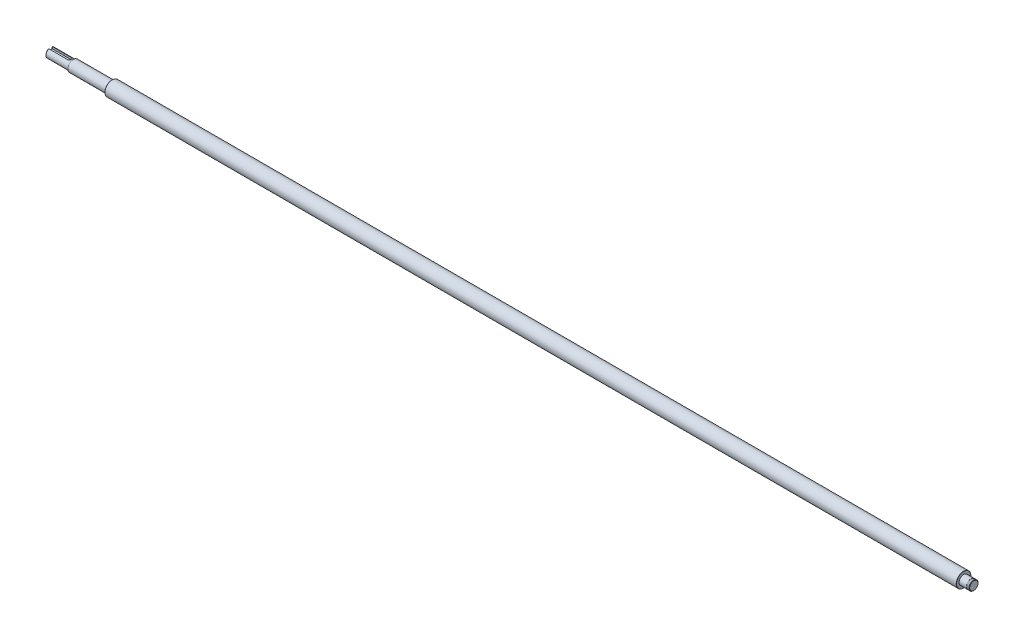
ISO-10303-21;
HEADER;
FILE_DESCRIPTION(('STEP AP214'),'2;1');
FILE_NAME('part.step','',(''),(''),'','','');
FILE_SCHEMA(('AUTOMOTIVE_DESIGN { 1 0 10303 214 1 1 1 1 }'));
ENDSEC;
DATA;
#1=APPLICATION_CONTEXT('core data for automotive mechanical design processes');
#2=APPLICATION_PROTOCOL_DEFINITION('international standard','automotive_design',2000,#1);
#3=PRODUCT_CONTEXT('',#1,'mechanical');
#4=PRODUCT('Part','Part','',(#3));
#5=PRODUCT_RELATED_PRODUCT_CATEGORY('part','',(#4));
#6=PRODUCT_DEFINITION_FORMATION('','',#4);
#7=PRODUCT_DEFINITION_CONTEXT('part definition',#1,'design');
#8=PRODUCT_DEFINITION('design','',#6,#7);
#9=PRODUCT_DEFINITION_SHAPE('','',#8);
#10=(LENGTH_UNIT() NAMED_UNIT(*) SI_UNIT(.MILLI.,.METRE.));
#11=(NAMED_UNIT(*) PLANE_ANGLE_UNIT() SI_UNIT($,.RADIAN.));
#12=(NAMED_UNIT(*) SI_UNIT($,.STERADIAN.) SOLID_ANGLE_UNIT());
#13=UNCERTAINTY_MEASURE_WITH_UNIT(LENGTH_MEASURE(1.E-05),#10,'distance_accuracy_value','');
#14=(GEOMETRIC_REPRESENTATION_CONTEXT(3) GLOBAL_UNCERTAINTY_ASSIGNED_CONTEXT((#13)) GLOBAL_UNIT_ASSIGNED_CONTEXT((#10,
#11,#12)) REPRESENTATION_CONTEXT('',''));
#15=CARTESIAN_POINT('',(0.,0.,0.));
#16=DIRECTION('',(0.,0.,1.));
#17=DIRECTION('',(1.,0.,0.));
#18=AXIS2_PLACEMENT_3D('',#15,#16,#17);
#19=CARTESIAN_POINT('',(-23.2450331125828,0.,0.));
#20=DIRECTION('',(-1.,0.,0.));
#21=DIRECTION('',(0.,-1.,0.));
#22=AXIS2_PLACEMENT_3D('',#19,#20,#21);
#23=PLANE('',#22);
#24=DIRECTION('',(0.,1.,0.));
#25=VECTOR('',#24,1.);
#26=CARTESIAN_POINT('',(-23.2450331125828,2.5,-2.));
#27=LINE('',#26,#25);
#28=CARTESIAN_POINT('',(-23.2450331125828,2.5,-2.));
#29=VERTEX_POINT('',#28);
#30=CARTESIAN_POINT('',(-23.2450331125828,4.03112887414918,-2.));
#31=VERTEX_POINT('',#30);
#32=EDGE_CURVE('E132',#29,#31,#27,.T.);
#33=ORIENTED_EDGE('',*,*,#32,.T.);
#34=CARTESIAN_POINT('',(-23.2450331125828,0.,0.));
#35=DIRECTION('',(-1.,0.,0.));
#36=DIRECTION('',(0.,-1.,0.));
#37=AXIS2_PLACEMENT_3D('',#34,#35,#36);
#38=CIRCLE('',#37,4.49999999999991);
#39=CARTESIAN_POINT('',(-23.2450331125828,4.03112887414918,2.));
#40=VERTEX_POINT('',#39);
#41=EDGE_CURVE('E119',#31,#40,#38,.T.);
#42=ORIENTED_EDGE('',*,*,#41,.T.);
#43=DIRECTION('',(0.,1.,0.));
#44=VECTOR('',#43,1.);
#45=CARTESIAN_POINT('',(-23.2450331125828,2.5,2.));
#46=LINE('',#45,#44);
#47=CARTESIAN_POINT('',(-23.2450331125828,2.5,2.));
#48=VERTEX_POINT('',#47);
#49=EDGE_CURVE('E68',#48,#40,#46,.T.);
#50=ORIENTED_EDGE('',*,*,#49,.F.);
#51=DIRECTION('',(0.,0.,-1.));
#52=VECTOR('',#51,1.);
#53=CARTESIAN_POINT('',(-23.2450331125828,2.5,0.));
#54=LINE('',#53,#52);
#55=EDGE_CURVE('E11',#48,#29,#54,.T.);
#56=ORIENTED_EDGE('',*,*,#55,.T.);
#57=EDGE_LOOP('',(#33,#42,#50,#56));
#58=FACE_BOUND('',#57,.T.);
#59=ADVANCED_FACE('F51',(#58),#23,.T.);
#60=CARTESIAN_POINT('',(976.754966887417,1.22298005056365E-13,0.));
#61=DIRECTION('',(1.,0.,0.));
#62=DIRECTION('',(0.,1.,0.));
#63=AXIS2_PLACEMENT_3D('',#60,#61,#62);
#64=CYLINDRICAL_SURFACE('',#63,5.);
#65=CARTESIAN_POINT('',(-2.24503311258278,4.58257569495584,2.));
#66=CARTESIAN_POINT('',(-2.19122726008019,4.58256464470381,2.00000798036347));
#67=CARTESIAN_POINT('',(-2.13742744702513,4.58352306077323,1.99782891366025));
#68=CARTESIAN_POINT('',(-2.03026181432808,4.58729625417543,1.98915905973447));
#69=CARTESIAN_POINT('',(-1.97689583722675,4.59011032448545,1.98266991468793));
#70=CARTESIAN_POINT('',(-1.87118629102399,4.5974978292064,1.9654760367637));
#71=CARTESIAN_POINT('',(-1.81883952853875,4.60206430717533,1.95478796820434));
#72=CARTESIAN_POINT('',(-1.71533234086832,4.61280053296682,1.9293163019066));
#73=CARTESIAN_POINT('',(-1.66417198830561,4.61897037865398,1.9145324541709));
#74=CARTESIAN_POINT('',(-1.51309726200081,4.63959291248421,1.86426971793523));
#75=CARTESIAN_POINT('',(-1.41537888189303,4.6561744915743,1.82284489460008));
#76=CARTESIAN_POINT('',(-1.22823753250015,4.6931237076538,1.72548191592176));
#77=CARTESIAN_POINT('',(-1.13882255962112,4.71349493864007,1.66952996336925));
#78=CARTESIAN_POINT('',(-0.965770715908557,4.75700999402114,1.54131835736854));
#79=CARTESIAN_POINT('',(-0.88266589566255,4.78024245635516,1.4683691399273));
#80=CARTESIAN_POINT('',(-0.729492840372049,4.82612790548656,1.30969646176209));
#81=CARTESIAN_POINT('',(-0.659427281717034,4.84878077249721,1.22397038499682));
#82=CARTESIAN_POINT('',(-0.53162671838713,4.89203417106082,1.03800590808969));
#83=CARTESIAN_POINT('',(-0.474488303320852,4.91251824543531,0.937327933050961));
#84=CARTESIAN_POINT('',(-0.378189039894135,4.94803944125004,0.726824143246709));
#85=CARTESIAN_POINT('',(-0.339020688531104,4.96307883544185,0.617002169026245));
#86=CARTESIAN_POINT('',(-0.281691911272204,4.98538314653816,0.396967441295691));
#87=CARTESIAN_POINT('',(-0.262606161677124,4.99298922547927,0.28703105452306));
#88=CARTESIAN_POINT('',(-0.243004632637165,5.00080310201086,0.0652684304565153));
#89=CARTESIAN_POINT('',(-0.242482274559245,5.0010135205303,-0.0465571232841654));
#90=CARTESIAN_POINT('',(-0.259515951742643,4.99421960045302,-0.262233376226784));
#91=CARTESIAN_POINT('',(-0.276058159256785,4.98761985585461,-0.366179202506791));
#92=CARTESIAN_POINT('',(-0.325026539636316,4.96849270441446,-0.569674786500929));
#93=CARTESIAN_POINT('',(-0.357453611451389,4.95596496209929,-0.669224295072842));
#94=CARTESIAN_POINT('',(-0.437669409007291,4.92596830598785,-0.862897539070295));
#95=CARTESIAN_POINT('',(-0.485682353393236,4.90842774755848,-0.95691685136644));
#96=CARTESIAN_POINT('',(-0.595497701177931,4.87014602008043,-1.13580746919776));
#97=CARTESIAN_POINT('',(-0.657304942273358,4.84940372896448,-1.22067554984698));
#98=CARTESIAN_POINT('',(-0.797677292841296,4.80521782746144,-1.38476339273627));
#99=CARTESIAN_POINT('',(-0.877075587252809,4.78168627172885,-1.46324770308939));
#100=CARTESIAN_POINT('',(-1.04801320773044,4.7356195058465,-1.60609926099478));
#101=CARTESIAN_POINT('',(-1.13955803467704,4.71308475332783,-1.67046007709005));
#102=CARTESIAN_POINT('',(-1.33550339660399,4.67095688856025,-1.78493657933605));
#103=CARTESIAN_POINT('',(-1.44019794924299,4.65146702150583,-1.83458932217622));
#104=CARTESIAN_POINT('',(-1.65739463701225,4.61886105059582,-1.91521298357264));
#105=CARTESIAN_POINT('',(-1.76988255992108,4.60573367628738,-1.94621696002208));
#106=CARTESIAN_POINT('',(-1.94377674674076,4.59208303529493,-1.9781058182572));
#107=CARTESIAN_POINT('',(-2.00369066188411,4.58853437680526,-1.98630505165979));
#108=CARTESIAN_POINT('',(-2.12406813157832,4.58377540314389,-1.99725282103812));
#109=CARTESIAN_POINT('',(-2.18453132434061,4.58256364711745,-2.00000471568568));
#110=CARTESIAN_POINT('',(-2.24503311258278,4.58257569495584,-2.));
#111=B_SPLINE_CURVE_WITH_KNOTS('',3,(#65,#66,#67,#68,#69,#70,#71,#72,#73,#74,#75,#76,#77,#78,
#79,#80,#81,#82,#83,#84,#85,#86,#87,#88,#89,#90,#91,#92,#93,#94,#95,#96,#97,#98,#99,#100,#101,
#102,#103,#104,#105,#106,#107,#108,#109,#110),.UNSPECIFIED.,.F.,.F.,(4,2,2,2,2,2,2,2,2,2,2,2,2,
2,2,2,2,2,2,2,2,2,4),(0.,0.161354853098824,0.322648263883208,0.483307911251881,
0.643977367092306,0.964683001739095,1.28569434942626,1.62318047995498,1.96073580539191,
2.31162858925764,2.66237473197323,2.9961387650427,3.32978451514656,3.64468915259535,
3.95961161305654,4.27928176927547,4.59906421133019,4.93981874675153,5.28072813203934,
5.63144241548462,5.98153315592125,6.16300192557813,6.3443587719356),.UNSPECIFIED.);
#112=CARTESIAN_POINT('',(-2.24503311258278,4.58257569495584,2.));
#113=VERTEX_POINT('',#112);
#114=CARTESIAN_POINT('',(-2.24503311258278,4.58257569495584,-2.));
#115=VERTEX_POINT('',#114);
#116=EDGE_CURVE('E61',#113,#115,#111,.T.);
#117=ORIENTED_EDGE('',*,*,#116,.F.);
#118=DIRECTION('',(1.,0.,0.));
#119=VECTOR('',#118,1.);
#120=CARTESIAN_POINT('',(976.754966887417,4.58257569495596,2.));
#121=LINE('',#120,#119);
#122=CARTESIAN_POINT('',(-22.7450331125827,4.58257569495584,2.));
#123=VERTEX_POINT('',#122);
#124=EDGE_CURVE('E129',#123,#113,#121,.T.);
#125=ORIENTED_EDGE('',*,*,#124,.F.);
#126=CARTESIAN_POINT('',(-22.7450331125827,0.,0.));
#127=DIRECTION('',(-1.,0.,0.));
#128=DIRECTION('',(0.,-1.,0.));
#129=AXIS2_PLACEMENT_3D('',#126,#127,#128);
#130=CIRCLE('',#129,5.);
#131=CARTESIAN_POINT('',(-22.7450331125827,4.58257569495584,-2.));
#132=VERTEX_POINT('',#131);
#133=EDGE_CURVE('E163',#123,#132,#130,.F.);
#134=ORIENTED_EDGE('',*,*,#133,.T.);
#135=DIRECTION('',(1.,0.,0.));
#136=VECTOR('',#135,1.);
#137=CARTESIAN_POINT('',(976.754966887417,4.58257569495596,-2.));
#138=LINE('',#137,#136);
#139=EDGE_CURVE('E76',#115,#132,#138,.F.);
#140=ORIENTED_EDGE('',*,*,#139,.F.);
#141=EDGE_LOOP('',(#117,#125,#134,#140));
#142=FACE_BOUND('',#141,.T.);
#143=CARTESIAN_POINT('',(1.75496688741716,0.,0.));
#144=DIRECTION('',(1.,0.,0.));
#145=DIRECTION('',(0.,1.,0.));
#146=AXIS2_PLACEMENT_3D('',#143,#144,#145);
#147=CIRCLE('',#146,5.);
#148=CARTESIAN_POINT('',(1.75496688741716,5.,0.));
#149=VERTEX_POINT('',#148);
#150=EDGE_CURVE('E159',#149,#149,#147,.T.);
#151=ORIENTED_EDGE('',*,*,#150,.F.);
#152=EDGE_LOOP('',(#151));
#153=FACE_BOUND('',#152,.T.);
#154=ADVANCED_FACE('F270',(#142,#153),#64,.T.);
#155=CARTESIAN_POINT('',(1.75496688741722,5.,0.));
#156=DIRECTION('',(-1.,0.,0.));
#157=DIRECTION('',(0.,-1.,0.));
#158=AXIS2_PLACEMENT_3D('',#155,#156,#157);
#159=PLANE('',#158);
#160=CARTESIAN_POINT('',(1.75496688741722,0.,0.));
#161=DIRECTION('',(-1.,0.,0.));
#162=DIRECTION('',(0.,-1.,0.));
#163=AXIS2_PLACEMENT_3D('',#160,#161,#162);
#164=CIRCLE('',#163,5.79999999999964);
#165=CARTESIAN_POINT('',(1.75496688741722,5.79999999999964,0.));
#166=VERTEX_POINT('',#165);
#167=EDGE_CURVE('E197',#166,#166,#164,.T.);
#168=ORIENTED_EDGE('',*,*,#167,.T.);
#169=EDGE_LOOP('',(#168));
#170=FACE_BOUND('',#169,.T.);
#171=ORIENTED_EDGE('',*,*,#150,.T.);
#172=EDGE_LOOP('',(#171));
#173=FACE_BOUND('',#172,.T.);
#174=ADVANCED_FACE('F266',(#170,#173),#159,.T.);
#175=CARTESIAN_POINT('',(976.754966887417,1.22298005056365E-13,0.));
#176=DIRECTION('',(1.,0.,0.));
#177=DIRECTION('',(0.,1.,0.));
#178=AXIS2_PLACEMENT_3D('',#175,#176,#177);
#179=CYLINDRICAL_SURFACE('',#178,6.);
#180=CARTESIAN_POINT('',(1.95496688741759,0.,0.));
#181=DIRECTION('',(-1.,0.,0.));
#182=DIRECTION('',(0.,-1.,0.));
#183=AXIS2_PLACEMENT_3D('',#180,#181,#182);
#184=CIRCLE('',#183,6.);
#185=CARTESIAN_POINT('',(1.95496688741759,6.,0.));
#186=VERTEX_POINT('',#185);
#187=EDGE_CURVE('E193',#186,#186,#184,.F.);
#188=ORIENTED_EDGE('',*,*,#187,.T.);
#189=EDGE_LOOP('',(#188));
#190=FACE_BOUND('',#189,.T.);
#191=CARTESIAN_POINT('',(43.7549668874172,0.,0.));
#192=DIRECTION('',(1.,0.,0.));
#193=DIRECTION('',(0.,1.,0.));
#194=AXIS2_PLACEMENT_3D('',#191,#192,#193);
#195=CIRCLE('',#194,5.99999999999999);
#196=CARTESIAN_POINT('',(43.7549668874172,6.,0.));
#197=VERTEX_POINT('',#196);
#198=EDGE_CURVE('E155',#197,#197,#195,.T.);
#199=ORIENTED_EDGE('',*,*,#198,.F.);
#200=EDGE_LOOP('',(#199));
#201=FACE_BOUND('',#200,.T.);
#202=ADVANCED_FACE('F262',(#190,#201),#179,.T.);
#203=CARTESIAN_POINT('',(43.7549668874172,6.,0.));
#204=DIRECTION('',(-1.,0.,0.));
#205=DIRECTION('',(0.,-1.,0.));
#206=AXIS2_PLACEMENT_3D('',#203,#204,#205);
#207=PLANE('',#206);
#208=CARTESIAN_POINT('',(43.7549668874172,0.,0.));
#209=DIRECTION('',(-1.,0.,0.));
#210=DIRECTION('',(0.,-1.,0.));
#211=AXIS2_PLACEMENT_3D('',#208,#209,#210);
#212=CIRCLE('',#211,7.70000000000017);
#213=CARTESIAN_POINT('',(43.7549668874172,-7.70000000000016,0.));
#214=VERTEX_POINT('',#213);
#215=EDGE_CURVE('E189',#214,#214,#212,.T.);
#216=ORIENTED_EDGE('',*,*,#215,.T.);
#217=EDGE_LOOP('',(#216));
#218=FACE_BOUND('',#217,.T.);
#219=ORIENTED_EDGE('',*,*,#198,.T.);
#220=EDGE_LOOP('',(#219));
#221=FACE_BOUND('',#220,.T.);
#222=ADVANCED_FACE('F258',(#218,#221),#207,.T.);
#223=CARTESIAN_POINT('',(976.754966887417,1.22298005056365E-13,0.));
#224=DIRECTION('',(1.,0.,0.));
#225=DIRECTION('',(0.,1.,0.));
#226=AXIS2_PLACEMENT_3D('',#223,#224,#225);
#227=CYLINDRICAL_SURFACE('',#226,7.89999999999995);
#228=CARTESIAN_POINT('',(965.554966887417,1.20928267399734E-13,0.));
#229=DIRECTION('',(1.,0.,0.));
#230=DIRECTION('',(0.,1.,0.));
#231=AXIS2_PLACEMENT_3D('',#228,#229,#230);
#232=CIRCLE('',#231,7.89999999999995);
#233=CARTESIAN_POINT('',(965.554966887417,7.90000000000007,0.));
#234=VERTEX_POINT('',#233);
#235=EDGE_CURVE('E185',#234,#234,#232,.F.);
#236=ORIENTED_EDGE('',*,*,#235,.T.);
#237=EDGE_LOOP('',(#236));
#238=FACE_BOUND('',#237,.T.);
#239=CARTESIAN_POINT('',(43.9549668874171,0.,0.));
#240=DIRECTION('',(-1.,0.,0.));
#241=DIRECTION('',(0.,-1.,0.));
#242=AXIS2_PLACEMENT_3D('',#239,#240,#241);
#243=CIRCLE('',#242,7.89999999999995);
#244=CARTESIAN_POINT('',(43.9549668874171,-7.89999999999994,0.));
#245=VERTEX_POINT('',#244);
#246=EDGE_CURVE('E181',#245,#245,#243,.F.);
#247=ORIENTED_EDGE('',*,*,#246,.T.);
#248=EDGE_LOOP('',(#247));
#249=FACE_BOUND('',#248,.T.);
#250=ADVANCED_FACE('F254',(#238,#249),#227,.T.);
#251=CARTESIAN_POINT('',(965.754966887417,7.90000000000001,0.));
#252=DIRECTION('',(1.,0.,0.));
#253=DIRECTION('',(0.,1.,0.));
#254=AXIS2_PLACEMENT_3D('',#251,#252,#253);
#255=PLANE('',#254);
#256=CARTESIAN_POINT('',(965.754966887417,1.20952727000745E-13,0.));
#257=DIRECTION('',(1.,0.,0.));
#258=DIRECTION('',(0.,1.,0.));
#259=AXIS2_PLACEMENT_3D('',#256,#257,#258);
#260=CIRCLE('',#259,7.69999999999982);
#261=CARTESIAN_POINT('',(965.754966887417,7.69999999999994,0.));
#262=VERTEX_POINT('',#261);
#263=EDGE_CURVE('E177',#262,#262,#260,.T.);
#264=ORIENTED_EDGE('',*,*,#263,.T.);
#265=EDGE_LOOP('',(#264));
#266=FACE_BOUND('',#265,.T.);
#267=CARTESIAN_POINT('',(965.754966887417,1.20952727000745E-13,0.));
#268=DIRECTION('',(1.,0.,0.));
#269=DIRECTION('',(0.,1.,0.));
#270=AXIS2_PLACEMENT_3D('',#267,#268,#269);
#271=CIRCLE('',#270,5.00000000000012);
#272=CARTESIAN_POINT('',(965.754966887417,5.00000000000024,0.));
#273=VERTEX_POINT('',#272);
#274=EDGE_CURVE('E151',#273,#273,#271,.T.);
#275=ORIENTED_EDGE('',*,*,#274,.F.);
#276=EDGE_LOOP('',(#275));
#277=FACE_BOUND('',#276,.T.);
#278=ADVANCED_FACE('F250',(#266,#277),#255,.T.);
#279=CARTESIAN_POINT('',(976.754966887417,1.22298005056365E-13,0.));
#280=DIRECTION('',(1.,0.,0.));
#281=DIRECTION('',(0.,1.,0.));
#282=AXIS2_PLACEMENT_3D('',#279,#280,#281);
#283=CYLINDRICAL_SURFACE('',#282,5.00000000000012);
#284=ORIENTED_EDGE('',*,*,#274,.T.);
#285=EDGE_LOOP('',(#284));
#286=FACE_BOUND('',#285,.T.);
#287=CARTESIAN_POINT('',(973.754966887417,1.21931111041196E-13,0.));
#288=DIRECTION('',(1.,0.,0.));
#289=DIRECTION('',(0.,1.,0.));
#290=AXIS2_PLACEMENT_3D('',#287,#288,#289);
#291=CIRCLE('',#290,5.00000000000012);
#292=CARTESIAN_POINT('',(973.754966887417,5.00000000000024,0.));
#293=VERTEX_POINT('',#292);
#294=EDGE_CURVE('E147',#293,#293,#291,.T.);
#295=ORIENTED_EDGE('',*,*,#294,.F.);
#296=EDGE_LOOP('',(#295));
#297=FACE_BOUND('',#296,.T.);
#298=ADVANCED_FACE('F246',(#286,#297),#283,.T.);
#299=CARTESIAN_POINT('',(973.754966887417,5.00000000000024,0.));
#300=DIRECTION('',(1.,0.,0.));
#301=DIRECTION('',(0.,1.,0.));
#302=AXIS2_PLACEMENT_3D('',#299,#300,#301);
#303=PLANE('',#302);
#304=ORIENTED_EDGE('',*,*,#294,.T.);
#305=EDGE_LOOP('',(#304));
#306=FACE_BOUND('',#305,.T.);
#307=CARTESIAN_POINT('',(973.754966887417,1.21931111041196E-13,0.));
#308=DIRECTION('',(1.,0.,0.));
#309=DIRECTION('',(0.,1.,0.));
#310=AXIS2_PLACEMENT_3D('',#307,#308,#309);
#311=CIRCLE('',#310,4.80000000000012);
#312=CARTESIAN_POINT('',(973.754966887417,4.80000000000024,0.));
#313=VERTEX_POINT('',#312);
#314=EDGE_CURVE('E143',#313,#313,#311,.T.);
#315=ORIENTED_EDGE('',*,*,#314,.F.);
#316=EDGE_LOOP('',(#315));
#317=FACE_BOUND('',#316,.T.);
#318=ADVANCED_FACE('F242',(#306,#317),#303,.T.);
#319=CARTESIAN_POINT('',(976.754966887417,1.22298005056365E-13,0.));
#320=DIRECTION('',(1.,0.,0.));
#321=DIRECTION('',(0.,1.,0.));
#322=AXIS2_PLACEMENT_3D('',#319,#320,#321);
#323=CYLINDRICAL_SURFACE('',#322,4.80000000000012);
#324=ORIENTED_EDGE('',*,*,#314,.T.);
#325=EDGE_LOOP('',(#324));
#326=FACE_BOUND('',#325,.T.);
#327=CARTESIAN_POINT('',(974.904966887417,1.22071753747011E-13,0.));
#328=DIRECTION('',(1.,0.,0.));
#329=DIRECTION('',(0.,1.,0.));
#330=AXIS2_PLACEMENT_3D('',#327,#328,#329);
#331=CIRCLE('',#330,4.80000000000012);
#332=CARTESIAN_POINT('',(974.904966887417,4.80000000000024,0.));
#333=VERTEX_POINT('',#332);
#334=EDGE_CURVE('E139',#333,#333,#331,.T.);
#335=ORIENTED_EDGE('',*,*,#334,.F.);
#336=EDGE_LOOP('',(#335));
#337=FACE_BOUND('',#336,.T.);
#338=ADVANCED_FACE('F238',(#326,#337),#323,.T.);
#339=CARTESIAN_POINT('',(974.904966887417,4.80000000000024,0.));
#340=DIRECTION('',(-1.,0.,0.));
#341=DIRECTION('',(0.,-1.,0.));
#342=AXIS2_PLACEMENT_3D('',#339,#340,#341);
#343=PLANE('',#342);
#344=ORIENTED_EDGE('',*,*,#334,.T.);
#345=EDGE_LOOP('',(#344));
#346=FACE_BOUND('',#345,.T.);
#347=CARTESIAN_POINT('',(974.904966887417,1.22071753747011E-13,0.));
#348=DIRECTION('',(1.,0.,0.));
#349=DIRECTION('',(0.,1.,0.));
#350=AXIS2_PLACEMENT_3D('',#347,#348,#349);
#351=CIRCLE('',#350,5.00000000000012);
#352=CARTESIAN_POINT('',(974.904966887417,5.00000000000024,0.));
#353=VERTEX_POINT('',#352);
#354=EDGE_CURVE('E135',#353,#353,#351,.T.);
#355=ORIENTED_EDGE('',*,*,#354,.F.);
#356=EDGE_LOOP('',(#355));
#357=FACE_BOUND('',#356,.T.);
#358=ADVANCED_FACE('F234',(#346,#357),#343,.T.);
#359=CARTESIAN_POINT('',(976.754966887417,1.22298005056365E-13,0.));
#360=DIRECTION('',(1.,0.,0.));
#361=DIRECTION('',(0.,1.,0.));
#362=AXIS2_PLACEMENT_3D('',#359,#360,#361);
#363=CYLINDRICAL_SURFACE('',#362,5.00000000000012);
#364=CARTESIAN_POINT('',(976.254966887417,1.22236856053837E-13,0.));
#365=DIRECTION('',(1.,0.,0.));
#366=DIRECTION('',(0.,1.,0.));
#367=AXIS2_PLACEMENT_3D('',#364,#365,#366);
#368=CIRCLE('',#367,5.00000000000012);
#369=CARTESIAN_POINT('',(976.254966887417,5.00000000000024,0.));
#370=VERTEX_POINT('',#369);
#371=EDGE_CURVE('E173',#370,#370,#368,.F.);
#372=ORIENTED_EDGE('',*,*,#371,.T.);
#373=EDGE_LOOP('',(#372));
#374=FACE_BOUND('',#373,.T.);
#375=ORIENTED_EDGE('',*,*,#354,.T.);
#376=EDGE_LOOP('',(#375));
#377=FACE_BOUND('',#376,.T.);
#378=ADVANCED_FACE('F230',(#374,#377),#363,.T.);
#379=CARTESIAN_POINT('',(976.754966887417,5.00000000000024,0.));
#380=DIRECTION('',(1.,0.,0.));
#381=DIRECTION('',(0.,1.,0.));
#382=AXIS2_PLACEMENT_3D('',#379,#380,#381);
#383=PLANE('',#382);
#384=CARTESIAN_POINT('',(976.754966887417,1.22298005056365E-13,0.));
#385=DIRECTION('',(1.,0.,0.));
#386=DIRECTION('',(0.,1.,0.));
#387=AXIS2_PLACEMENT_3D('',#384,#385,#386);
#388=CIRCLE('',#387,4.50000000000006);
#389=CARTESIAN_POINT('',(976.754966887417,4.50000000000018,0.));
#390=VERTEX_POINT('',#389);
#391=EDGE_CURVE('E169',#390,#390,#388,.T.);
#392=ORIENTED_EDGE('',*,*,#391,.T.);
#393=EDGE_LOOP('',(#392));
#394=FACE_BOUND('',#393,.T.);
#395=ADVANCED_FACE('F227',(#394),#383,.T.);
#396=CARTESIAN_POINT('',(-22.7450331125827,0.,0.));
#397=DIRECTION('',(1.,0.,0.));
#398=DIRECTION('',(0.,1.,0.));
#399=AXIS2_PLACEMENT_3D('',#396,#397,#398);
#400=CONICAL_SURFACE('',#399,5.,0.785398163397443);
#401=CARTESIAN_POINT('',(-20.1953233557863,7.27998059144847,-2.));
#402=CARTESIAN_POINT('',(-20.3170852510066,7.15370542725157,-2.));
#403=CARTESIAN_POINT('',(-20.4387340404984,7.02732118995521,-2.));
#404=CARTESIAN_POINT('',(-20.6817619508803,6.77429279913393,-2.));
#405=CARTESIAN_POINT('',(-20.8031410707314,6.64764864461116,-2.));
#406=CARTESIAN_POINT('',(-21.1669443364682,6.26712180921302,-2.));
#407=CARTESIAN_POINT('',(-21.4088966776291,6.01278737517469,-2.));
#408=CARTESIAN_POINT('',(-21.8949008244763,5.49830066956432,-2.));
#409=CARTESIAN_POINT('',(-22.1389234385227,5.23812077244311,-2.));
#410=CARTESIAN_POINT('',(-22.624052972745,4.71529350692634,-2.));
#411=CARTESIAN_POINT('',(-22.865161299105,4.45264744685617,-2.));
#412=CARTESIAN_POINT('',(-23.3058176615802,3.96433977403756,-2.));
#413=CARTESIAN_POINT('',(-23.5060095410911,3.73926283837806,-2.));
#414=CARTESIAN_POINT('',(-23.8024970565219,3.3980458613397,-2.));
#415=CARTESIAN_POINT('',(-23.9007637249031,3.28362111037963,-2.));
#416=CARTESIAN_POINT('',(-24.0955383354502,3.05329465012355,-2.));
#417=CARTESIAN_POINT('',(-24.192046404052,2.93739304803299,-2.));
#418=CARTESIAN_POINT('',(-24.3822683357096,2.70420412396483,-2.));
#419=CARTESIAN_POINT('',(-24.4759930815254,2.586925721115,-2.));
#420=CARTESIAN_POINT('',(-24.6601918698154,2.34985534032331,-2.));
#421=CARTESIAN_POINT('',(-24.7506662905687,2.23006365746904,-2.));
#422=CARTESIAN_POINT('',(-24.9267855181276,1.98733912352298,-2.));
#423=CARTESIAN_POINT('',(-25.0124406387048,1.86441386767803,-2.));
#424=CARTESIAN_POINT('',(-25.1356570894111,1.6766184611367,-2.));
#425=CARTESIAN_POINT('',(-25.1758404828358,1.61347115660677,-2.));
#426=CARTESIAN_POINT('',(-25.2540161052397,1.48583869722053,-2.));
#427=CARTESIAN_POINT('',(-25.2920086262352,1.42135372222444,-2.));
#428=CARTESIAN_POINT('',(-25.366942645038,1.28783026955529,-2.));
#429=CARTESIAN_POINT('',(-25.403755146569,1.21871885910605,-2.));
#430=CARTESIAN_POINT('',(-25.473563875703,1.07854838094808,-2.));
#431=CARTESIAN_POINT('',(-25.5065589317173,1.00748872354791,-2.));
#432=CARTESIAN_POINT('',(-25.5674047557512,0.863864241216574,-2.));
#433=CARTESIAN_POINT('',(-25.595295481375,0.791316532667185,-2.));
#434=CARTESIAN_POINT('',(-25.6449927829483,0.64416691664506,-2.));
#435=CARTESIAN_POINT('',(-25.6668031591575,0.569566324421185,-2.));
#436=CARTESIAN_POINT('',(-25.6954987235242,0.449923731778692,-2.));
#437=CARTESIAN_POINT('',(-25.7048217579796,0.40546111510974,-2.));
#438=CARTESIAN_POINT('',(-25.7206933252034,0.316048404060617,-2.));
#439=CARTESIAN_POINT('',(-25.7272425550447,0.271098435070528,-2.));
#440=CARTESIAN_POINT('',(-25.7374389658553,0.180257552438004,-2.));
#441=CARTESIAN_POINT('',(-25.7410460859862,0.134362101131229,-2.));
#442=CARTESIAN_POINT('',(-25.7451166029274,0.0423963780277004,-2.));
#443=CARTESIAN_POINT('',(-25.7455774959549,-0.00367400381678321,-2.));
#444=CARTESIAN_POINT('',(-25.7444154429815,-0.049709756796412,-2.));
#445=B_SPLINE_CURVE_WITH_KNOTS('',3,(#401,#402,#403,#404,#405,#406,#407,#408,#409,#410,#411,
#412,#413,#414,#415,#416,#417,#418,#419,#420,#421,#422,#423,#424,#425,#426,#427,#428,#429,#430,
#431,#432,#433,#434,#435,#436,#437,#438,#439,#440,#441,#442,#443,#444),.UNSPECIFIED.,.F.,.F.,(4,
2,2,2,2,2,2,2,2,2,2,2,2,2,2,2,2,2,2,2,2,4),(0.,0.526253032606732,1.05250808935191,
2.10561295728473,3.17572388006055,4.24529600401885,5.14891143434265,5.60138529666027,
6.05382649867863,6.50416946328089,6.95445984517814,7.40374672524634,7.628258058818,
7.85273939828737,8.0875595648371,8.32245160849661,8.55541789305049,8.78823824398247,
8.92445173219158,9.06063096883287,9.19863489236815,9.33674862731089),.UNSPECIFIED.);
#446=EDGE_CURVE('E210',#132,#31,#445,.T.);
#447=ORIENTED_EDGE('',*,*,#446,.F.);
#448=ORIENTED_EDGE('',*,*,#133,.F.);
#449=CARTESIAN_POINT('',(-25.7444154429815,-0.0497097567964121,2.));
#450=CARTESIAN_POINT('',(-25.7456810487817,0.000222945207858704,2.));
#451=CARTESIAN_POINT('',(-25.7450303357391,0.0501945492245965,2.));
#452=CARTESIAN_POINT('',(-25.7400342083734,0.149901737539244,2.));
#453=CARTESIAN_POINT('',(-25.7356926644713,0.199637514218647,2.));
#454=CARTESIAN_POINT('',(-25.7235532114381,0.297869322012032,2.));
#455=CARTESIAN_POINT('',(-25.7158119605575,0.346372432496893,2.));
#456=CARTESIAN_POINT('',(-25.697154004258,0.442770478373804,2.));
#457=CARTESIAN_POINT('',(-25.6862363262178,0.490665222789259,2.));
#458=CARTESIAN_POINT('',(-25.6512873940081,0.625155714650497,2.));
#459=CARTESIAN_POINT('',(-25.6238923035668,0.710884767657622,2.));
#460=CARTESIAN_POINT('',(-25.5615801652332,0.879564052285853,2.));
#461=CARTESIAN_POINT('',(-25.5266564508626,0.962511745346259,2.));
#462=CARTESIAN_POINT('',(-25.4506951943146,1.12664922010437,2.));
#463=CARTESIAN_POINT('',(-25.4095940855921,1.20780926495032,2.));
#464=CARTESIAN_POINT('',(-25.3446717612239,1.3277270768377,2.));
#465=CARTESIAN_POINT('',(-25.3224897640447,1.36738964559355,2.));
#466=CARTESIAN_POINT('',(-25.2771695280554,1.44616326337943,2.));
#467=CARTESIAN_POINT('',(-25.2540313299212,1.48527433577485,2.));
#468=CARTESIAN_POINT('',(-25.1778819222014,1.61091323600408,2.));
#469=CARTESIAN_POINT('',(-25.1232172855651,1.69643993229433,2.));
#470=CARTESIAN_POINT('',(-25.0108139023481,1.86545721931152,2.));
#471=CARTESIAN_POINT('',(-24.9530744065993,1.9489473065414,2.));
#472=CARTESIAN_POINT('',(-24.8352205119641,2.11432674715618,2.));
#473=CARTESIAN_POINT('',(-24.7751042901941,2.19621479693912,2.));
#474=CARTESIAN_POINT('',(-24.6530611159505,2.35863333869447,2.));
#475=CARTESIAN_POINT('',(-24.5911340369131,2.43916373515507,2.));
#476=CARTESIAN_POINT('',(-24.4028957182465,2.6795331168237,2.));
#477=CARTESIAN_POINT('',(-24.2744539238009,2.83770156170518,2.));
#478=CARTESIAN_POINT('',(-24.0139846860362,3.15090765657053,2.));
#479=CARTESIAN_POINT('',(-23.8819588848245,3.30594668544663,2.));
#480=CARTESIAN_POINT('',(-23.6151614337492,3.61410998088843,2.));
#481=CARTESIAN_POINT('',(-23.4803854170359,3.76723045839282,2.));
#482=CARTESIAN_POINT('',(-23.2090190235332,4.07187968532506,2.));
#483=CARTESIAN_POINT('',(-23.0724284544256,4.2234082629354,2.));
#484=CARTESIAN_POINT('',(-22.7981272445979,4.52501918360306,2.));
#485=CARTESIAN_POINT('',(-22.6604186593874,4.6751033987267,2.));
#486=CARTESIAN_POINT('',(-22.3839912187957,4.97433889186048,2.));
#487=CARTESIAN_POINT('',(-22.24527235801,5.12349016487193,2.));
#488=CARTESIAN_POINT('',(-21.9479978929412,5.44143539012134,2.));
#489=CARTESIAN_POINT('',(-21.7893274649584,5.61012190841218,2.));
#490=CARTESIAN_POINT('',(-21.4711457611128,5.94682167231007,2.));
#491=CARTESIAN_POINT('',(-21.3116341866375,6.11483463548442,2.));
#492=CARTESIAN_POINT('',(-20.9928987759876,6.44933216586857,2.));
#493=CARTESIAN_POINT('',(-20.8336783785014,6.61582001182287,2.));
#494=CARTESIAN_POINT('',(-20.5148090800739,6.94825939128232,2.));
#495=CARTESIAN_POINT('',(-20.3551603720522,7.11421110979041,2.));
#496=CARTESIAN_POINT('',(-20.1953233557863,7.27998059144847,2.));
#497=B_SPLINE_CURVE_WITH_KNOTS('',3,(#449,#450,#451,#452,#453,#454,#455,#456,#457,#458,#459,
#460,#461,#462,#463,#464,#465,#466,#467,#468,#469,#470,#471,#472,#473,#474,#475,#476,#477,#478,
#479,#480,#481,#482,#483,#484,#485,#486,#487,#488,#489,#490,#491,#492,#493,#494,#495,#496),
.UNSPECIFIED.,.F.,.F.,(4,2,2,2,2,2,2,2,2,2,2,2,2,2,2,2,2,2,2,2,2,2,2,4),(0.,0.149795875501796,
0.299434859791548,0.44666942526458,0.593949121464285,0.863448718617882,1.1331879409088,
1.40592157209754,1.54224388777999,1.67856041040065,1.98297148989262,2.28745707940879,
2.59218091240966,2.89692609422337,3.50808023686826,4.11895893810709,4.7308975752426,
5.34290159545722,5.95396048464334,6.56502264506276,7.25977327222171,7.95478983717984,
8.64589224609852,9.3367231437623),.UNSPECIFIED.);
#498=EDGE_CURVE('E201',#40,#123,#497,.T.);
#499=ORIENTED_EDGE('',*,*,#498,.F.);
#500=ORIENTED_EDGE('',*,*,#41,.F.);
#501=EDGE_LOOP('',(#447,#448,#499,#500));
#502=FACE_BOUND('',#501,.T.);
#503=ADVANCED_FACE('F217',(#502),#400,.T.);
#504=CARTESIAN_POINT('',(976.754966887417,1.22298005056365E-13,0.));
#505=DIRECTION('',(-1.,0.,0.));
#506=DIRECTION('',(0.,-1.,0.));
#507=AXIS2_PLACEMENT_3D('',#504,#505,#506);
#508=CONICAL_SURFACE('',#507,4.50000000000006,0.785398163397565);
#509=ORIENTED_EDGE('',*,*,#371,.F.);
#510=EDGE_LOOP('',(#509));
#511=FACE_BOUND('',#510,.T.);
#512=ORIENTED_EDGE('',*,*,#391,.F.);
#513=EDGE_LOOP('',(#512));
#514=FACE_BOUND('',#513,.T.);
#515=ADVANCED_FACE('F318',(#511,#514),#508,.T.);
#516=CARTESIAN_POINT('',(965.754966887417,1.20952727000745E-13,0.));
#517=DIRECTION('',(-1.,0.,0.));
#518=DIRECTION('',(0.,-1.,0.));
#519=AXIS2_PLACEMENT_3D('',#516,#517,#518);
#520=CONICAL_SURFACE('',#519,7.69999999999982,0.785398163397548);
#521=ORIENTED_EDGE('',*,*,#235,.F.);
#522=EDGE_LOOP('',(#521));
#523=FACE_BOUND('',#522,.T.);
#524=ORIENTED_EDGE('',*,*,#263,.F.);
#525=EDGE_LOOP('',(#524));
#526=FACE_BOUND('',#525,.T.);
#527=ADVANCED_FACE('F360',(#523,#526),#520,.T.);
#528=CARTESIAN_POINT('',(43.9549668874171,0.,0.));
#529=DIRECTION('',(1.,0.,0.));
#530=DIRECTION('',(0.,1.,0.));
#531=AXIS2_PLACEMENT_3D('',#528,#529,#530);
#532=CONICAL_SURFACE('',#531,7.89999999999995,0.785398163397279);
#533=ORIENTED_EDGE('',*,*,#215,.F.);
#534=EDGE_LOOP('',(#533));
#535=FACE_BOUND('',#534,.T.);
#536=ORIENTED_EDGE('',*,*,#246,.F.);
#537=EDGE_LOOP('',(#536));
#538=FACE_BOUND('',#537,.T.);
#539=ADVANCED_FACE('F353',(#535,#538),#532,.T.);
#540=CARTESIAN_POINT('',(1.95496688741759,0.,0.));
#541=DIRECTION('',(1.,0.,0.));
#542=DIRECTION('',(0.,1.,0.));
#543=AXIS2_PLACEMENT_3D('',#540,#541,#542);
#544=CONICAL_SURFACE('',#543,6.,0.785398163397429);
#545=CARTESIAN_POINT('',(1.75496688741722,5.79999999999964,0.));
#546=CARTESIAN_POINT('',(1.75705022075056,5.80208333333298,0.));
#547=CARTESIAN_POINT('',(1.75913355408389,5.80416666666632,0.));
#548=CARTESIAN_POINT('',(1.76330022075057,5.80833333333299,0.));
#549=CARTESIAN_POINT('',(1.76538355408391,5.81041666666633,0.));
#550=CARTESIAN_POINT('',(1.76955022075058,5.814583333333,0.));
#551=CARTESIAN_POINT('',(1.77163355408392,5.81666666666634,0.));
#552=CARTESIAN_POINT('',(1.77580022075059,5.82083333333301,0.));
#553=CARTESIAN_POINT('',(1.77788355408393,5.82291666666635,0.));
#554=CARTESIAN_POINT('',(1.7820502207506,5.82708333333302,0.));
#555=CARTESIAN_POINT('',(1.78413355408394,5.82916666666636,0.));
#556=CARTESIAN_POINT('',(1.78830022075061,5.83333333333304,0.));
#557=CARTESIAN_POINT('',(1.79038355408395,5.83541666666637,0.));
#558=CARTESIAN_POINT('',(1.79455022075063,5.83958333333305,0.));
#559=CARTESIAN_POINT('',(1.79663355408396,5.84166666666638,0.));
#560=CARTESIAN_POINT('',(1.80080022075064,5.84583333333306,0.));
#561=CARTESIAN_POINT('',(1.80288355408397,5.84791666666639,0.));
#562=CARTESIAN_POINT('',(1.80705022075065,5.85208333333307,0.));
#563=CARTESIAN_POINT('',(1.80913355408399,5.8541666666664,0.));
#564=CARTESIAN_POINT('',(1.81330022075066,5.85833333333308,0.));
#565=CARTESIAN_POINT('',(1.815383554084,5.86041666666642,0.));
#566=CARTESIAN_POINT('',(1.81955022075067,5.86458333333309,0.));
#567=CARTESIAN_POINT('',(1.82163355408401,5.86666666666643,0.));
#568=CARTESIAN_POINT('',(1.82580022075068,5.8708333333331,0.));
#569=CARTESIAN_POINT('',(1.82788355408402,5.87291666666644,0.));
#570=CARTESIAN_POINT('',(1.83205022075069,5.87708333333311,0.));
#571=CARTESIAN_POINT('',(1.83413355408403,5.87916666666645,0.));
#572=CARTESIAN_POINT('',(1.83830022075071,5.88333333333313,0.));
#573=CARTESIAN_POINT('',(1.84038355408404,5.88541666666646,0.));
#574=CARTESIAN_POINT('',(1.84455022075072,5.88958333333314,0.));
#575=CARTESIAN_POINT('',(1.84663355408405,5.89166666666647,0.));
#576=CARTESIAN_POINT('',(1.85080022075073,5.89583333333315,0.));
#577=CARTESIAN_POINT('',(1.85288355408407,5.89791666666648,0.));
#578=CARTESIAN_POINT('',(1.85705022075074,5.90208333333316,0.));
#579=CARTESIAN_POINT('',(1.85913355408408,5.9041666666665,0.));
#580=CARTESIAN_POINT('',(1.86330022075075,5.90833333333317,0.));
#581=CARTESIAN_POINT('',(1.86538355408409,5.91041666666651,0.));
#582=CARTESIAN_POINT('',(1.86955022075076,5.91458333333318,0.));
#583=CARTESIAN_POINT('',(1.8716335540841,5.91666666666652,0.));
#584=CARTESIAN_POINT('',(1.87580022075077,5.92083333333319,0.));
#585=CARTESIAN_POINT('',(1.87788355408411,5.92291666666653,0.));
#586=CARTESIAN_POINT('',(1.88205022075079,5.9270833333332,0.));
#587=CARTESIAN_POINT('',(1.88413355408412,5.92916666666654,0.));
#588=CARTESIAN_POINT('',(1.8883002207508,5.93333333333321,0.));
#589=CARTESIAN_POINT('',(1.89038355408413,5.93541666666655,0.));
#590=CARTESIAN_POINT('',(1.89455022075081,5.93958333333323,0.));
#591=CARTESIAN_POINT('',(1.89663355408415,5.94166666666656,0.));
#592=CARTESIAN_POINT('',(1.90080022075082,5.94583333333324,0.));
#593=CARTESIAN_POINT('',(1.90288355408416,5.94791666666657,0.));
#594=CARTESIAN_POINT('',(1.90705022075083,5.95208333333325,0.));
#595=CARTESIAN_POINT('',(1.90913355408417,5.95416666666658,0.));
#596=CARTESIAN_POINT('',(1.91330022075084,5.95833333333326,0.));
#597=CARTESIAN_POINT('',(1.91538355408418,5.9604166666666,0.));
#598=CARTESIAN_POINT('',(1.91955022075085,5.96458333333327,0.));
#599=CARTESIAN_POINT('',(1.92163355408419,5.96666666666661,0.));
#600=CARTESIAN_POINT('',(1.92580022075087,5.97083333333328,0.));
#601=CARTESIAN_POINT('',(1.9278835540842,5.97291666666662,0.));
#602=CARTESIAN_POINT('',(1.93205022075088,5.97708333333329,0.));
#603=CARTESIAN_POINT('',(1.93413355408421,5.97916666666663,0.));
#604=CARTESIAN_POINT('',(1.93830022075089,5.9833333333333,0.));
#605=CARTESIAN_POINT('',(1.94038355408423,5.98541666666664,0.));
#606=CARTESIAN_POINT('',(1.9445502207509,5.98958333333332,0.));
#607=CARTESIAN_POINT('',(1.94663355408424,5.99166666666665,0.));
#608=CARTESIAN_POINT('',(1.95080022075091,5.99583333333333,0.));
#609=CARTESIAN_POINT('',(1.95288355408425,5.99791666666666,0.));
#610=CARTESIAN_POINT('',(1.95496688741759,6.,0.));
#611=B_SPLINE_CURVE_WITH_KNOTS('',3,(#545,#546,#547,#548,#549,#550,#551,#552,#553,#554,#555,
#556,#557,#558,#559,#560,#561,#562,#563,#564,#565,#566,#567,#568,#569,#570,#571,#572,#573,#574,
#575,#576,#577,#578,#579,#580,#581,#582,#583,#584,#585,#586,#587,#588,#589,#590,#591,#592,#593,
#594,#595,#596,#597,#598,#599,#600,#601,#602,#603,#604,#605,#606,#607,#608,#609,#610),
.UNSPECIFIED.,.F.,.F.,(4,2,2,2,2,2,2,2,2,2,2,2,2,2,2,2,2,2,2,2,2,2,2,2,2,2,2,2,2,2,2,2,4),(0.,
0.00883883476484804,0.0176776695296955,0.0265165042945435,0.0353553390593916,0.044194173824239,
0.053033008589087,0.0618718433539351,0.0707106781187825,0.0795495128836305,0.0883883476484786,
0.0972271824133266,0.106066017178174,0.114904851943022,0.12374368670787,0.132582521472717,
0.141421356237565,0.150260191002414,0.159099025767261,0.167937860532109,0.176776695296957,
0.185615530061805,0.194454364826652,0.203293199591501,0.212132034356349,0.220970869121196,
0.229809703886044,0.238648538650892,0.247487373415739,0.256326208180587,0.265165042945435,
0.274003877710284,0.282842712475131),.UNSPECIFIED.);
#612=EDGE_CURVE('BSEAM54',#166,#186,#611,.T.);
#613=ORIENTED_EDGE('',*,*,#167,.F.);
#614=ORIENTED_EDGE('',*,*,#187,.F.);
#615=ORIENTED_EDGE('',*,*,#612,.T.);
#616=ORIENTED_EDGE('',*,*,#612,.F.);
#617=EDGE_LOOP('',(#613,#615,#614,#616));
#618=FACE_BOUND('',#617,.T.);
#619=ADVANCED_FACE('F54',(#618),#544,.T.);
#620=CARTESIAN_POINT('',(-23.2450331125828,2.5,-2.));
#621=DIRECTION('',(0.,0.,-1.));
#622=DIRECTION('',(-1.,0.,0.));
#623=AXIS2_PLACEMENT_3D('',#620,#621,#622);
#624=PLANE('',#623);
#625=ORIENTED_EDGE('',*,*,#139,.T.);
#626=ORIENTED_EDGE('',*,*,#446,.T.);
#627=ORIENTED_EDGE('',*,*,#32,.F.);
#628=DIRECTION('',(-1.,0.,0.));
#629=VECTOR('',#628,1.);
#630=CARTESIAN_POINT('',(-23.2450331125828,2.5,-2.));
#631=LINE('',#630,#629);
#632=CARTESIAN_POINT('',(-2.24503311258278,2.5,-2.));
#633=VERTEX_POINT('',#632);
#634=EDGE_CURVE('E106',#633,#29,#631,.T.);
#635=ORIENTED_EDGE('',*,*,#634,.F.);
#636=DIRECTION('',(0.,1.,0.));
#637=VECTOR('',#636,1.);
#638=CARTESIAN_POINT('',(-2.24503311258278,2.5,-2.));
#639=LINE('',#638,#637);
#640=EDGE_CURVE('E124',#633,#115,#639,.T.);
#641=ORIENTED_EDGE('',*,*,#640,.T.);
#642=EDGE_LOOP('',(#625,#626,#627,#635,#641));
#643=FACE_BOUND('',#642,.T.);
#644=ADVANCED_FACE('F282',(#643),#624,.F.);
#645=CARTESIAN_POINT('',(-2.24503311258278,2.5,0.));
#646=DIRECTION('',(0.,1.,0.));
#647=DIRECTION('',(-1.,0.,0.));
#648=AXIS2_PLACEMENT_3D('',#645,#646,#647);
#649=CYLINDRICAL_SURFACE('',#648,2.);
#650=DIRECTION('',(0.,1.,0.));
#651=VECTOR('',#650,1.);
#652=CARTESIAN_POINT('',(-2.24503311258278,2.5,2.));
#653=LINE('',#652,#651);
#654=CARTESIAN_POINT('',(-2.24503311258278,2.5,2.));
#655=VERTEX_POINT('',#654);
#656=EDGE_CURVE('E112',#655,#113,#653,.T.);
#657=ORIENTED_EDGE('',*,*,#656,.T.);
#658=ORIENTED_EDGE('',*,*,#116,.T.);
#659=ORIENTED_EDGE('',*,*,#640,.F.);
#660=CARTESIAN_POINT('',(-2.24503311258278,2.5,0.));
#661=DIRECTION('',(0.,1.,0.));
#662=DIRECTION('',(-1.,0.,0.));
#663=AXIS2_PLACEMENT_3D('',#660,#661,#662);
#664=CIRCLE('',#663,2.);
#665=EDGE_CURVE('E115',#655,#633,#664,.T.);
#666=ORIENTED_EDGE('',*,*,#665,.F.);
#667=EDGE_LOOP('',(#657,#658,#659,#666));
#668=FACE_BOUND('',#667,.T.);
#669=ADVANCED_FACE('F225',(#668),#649,.F.);
#670=CARTESIAN_POINT('',(-23.2450331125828,2.5,2.));
#671=DIRECTION('',(0.,0.,1.));
#672=DIRECTION('',(1.,0.,0.));
#673=AXIS2_PLACEMENT_3D('',#670,#671,#672);
#674=PLANE('',#673);
#675=ORIENTED_EDGE('',*,*,#124,.T.);
#676=ORIENTED_EDGE('',*,*,#656,.F.);
#677=DIRECTION('',(1.,0.,0.));
#678=VECTOR('',#677,1.);
#679=CARTESIAN_POINT('',(-23.2450331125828,2.5,2.));
#680=LINE('',#679,#678);
#681=EDGE_CURVE('E104',#48,#655,#680,.T.);
#682=ORIENTED_EDGE('',*,*,#681,.F.);
#683=ORIENTED_EDGE('',*,*,#49,.T.);
#684=ORIENTED_EDGE('',*,*,#498,.T.);
#685=EDGE_LOOP('',(#675,#676,#682,#683,#684));
#686=FACE_BOUND('',#685,.T.);
#687=ADVANCED_FACE('F110',(#686),#674,.F.);
#688=CARTESIAN_POINT('',(-23.2450331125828,2.5,0.));
#689=DIRECTION('',(0.,1.,0.));
#690=DIRECTION('',(-1.,0.,0.));
#691=AXIS2_PLACEMENT_3D('',#688,#689,#690);
#692=PLANE('',#691);
#693=ORIENTED_EDGE('',*,*,#681,.T.);
#694=ORIENTED_EDGE('',*,*,#665,.T.);
#695=ORIENTED_EDGE('',*,*,#634,.T.);
#696=ORIENTED_EDGE('',*,*,#55,.F.);
#697=EDGE_LOOP('',(#693,#694,#695,#696));
#698=FACE_BOUND('',#697,.T.);
#699=ADVANCED_FACE('F102',(#698),#692,.T.);
#700=CLOSED_SHELL('',(#59,#154,#174,#202,#222,#250,#278,#298,#318,#338,#358,#378,#395,#503,#515,
#527,#539,#619,#644,#669,#687,#699));
#701=MANIFOLD_SOLID_BREP('B2',#700);
#702=ADVANCED_BREP_SHAPE_REPRESENTATION('',(#18,#701),#14);
#703=SHAPE_DEFINITION_REPRESENTATION(#9,#702);
ENDSEC;
END-ISO-10303-21;
